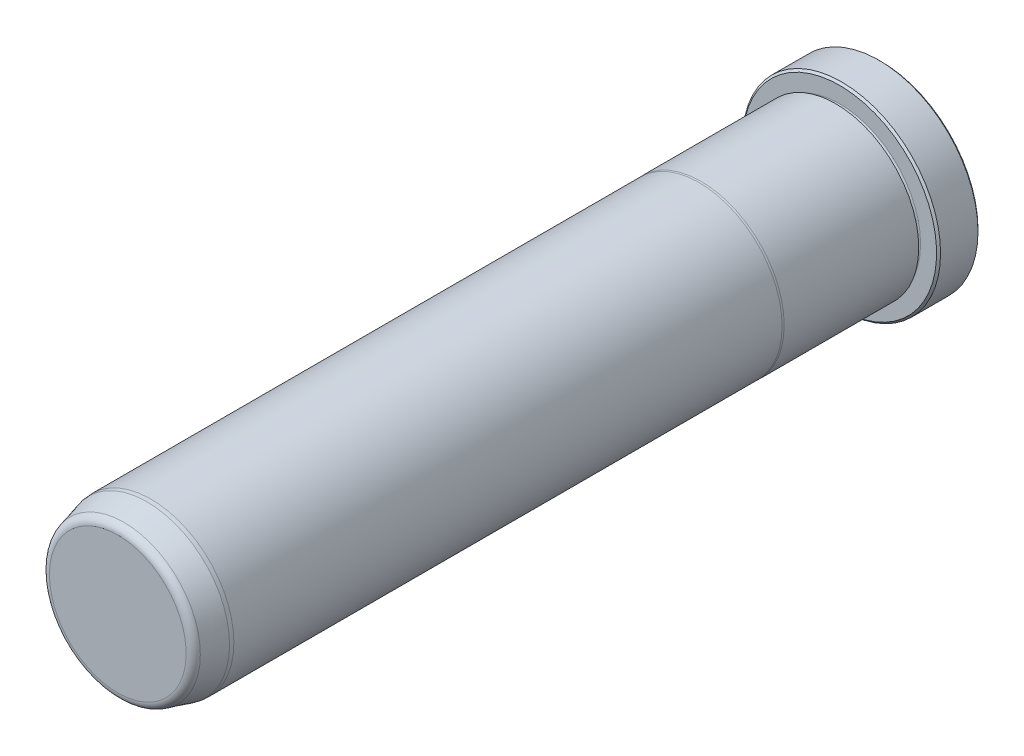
from build123d import *

# Parameters (mm, degrees)
FILLET6_R     = 1.5875
CHAMFER1_SIZE = 0.381


with BuildPart() as part:
    # Sketch1 → Revolve1 (revolve)
    with BuildSketch(Plane(origin=(0, 0, 0), x_dir=(0, 0, -1), z_dir=(1, 0, 0)), mode=Mode.PRIVATE) as revolve1_sk:
        with BuildLine():
            Line((0, 0), (0, 18.923))
            Line((0, 18.923), (-7.9248, 18.923))
            Line((-7.9248, 18.923), (-7.9248, 15.4813))
            ThreePointArc((-7.9248, 15.4813), (-8.3058, 15.1003), (-8.6868, 15.4813))
            Line((-8.6868, 15.4813), (-8.6868, 15.8877))
            Line((-8.6868, 15.8877), (-34.434763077, 15.8877))
            Line((-34.434763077, 15.8877), (-34.798, 15.8623))
            Line((-34.798, 15.8623), (-139.7, 15.8623))
            Line((-139.7, 15.8623), (-140.462, 15.795633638))
            Line((-140.462, 15.795633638), (-146.05, 14.298333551))
            Line((-146.05, 14.298333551), (-146.05, 0))
            Line((-146.05, 0), (0, 0))
        make_face()
    revolve(revolve1_sk.sketch.rotate(Axis((0, 0, 0), (0, 0, -1)), 90), axis=Axis((0, 0, 0), (0, 0, -1)))

    # Fillet6
    fillet6_edges = [part.edges().sort_by_distance(p)[0] for p in [
        (-14.298333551, 0, 146.05),
    ]]
    fillet(fillet6_edges, radius=FILLET6_R)

    # Chamfer1
    chamfer1_edges = [part.edges().sort_by_distance(p)[0] for p in [
        (-18.923, 0, 7.9248),
        (-18.923, 0, 0),
    ]]
    chamfer(chamfer1_edges, length=CHAMFER1_SIZE)


solid = part.part
